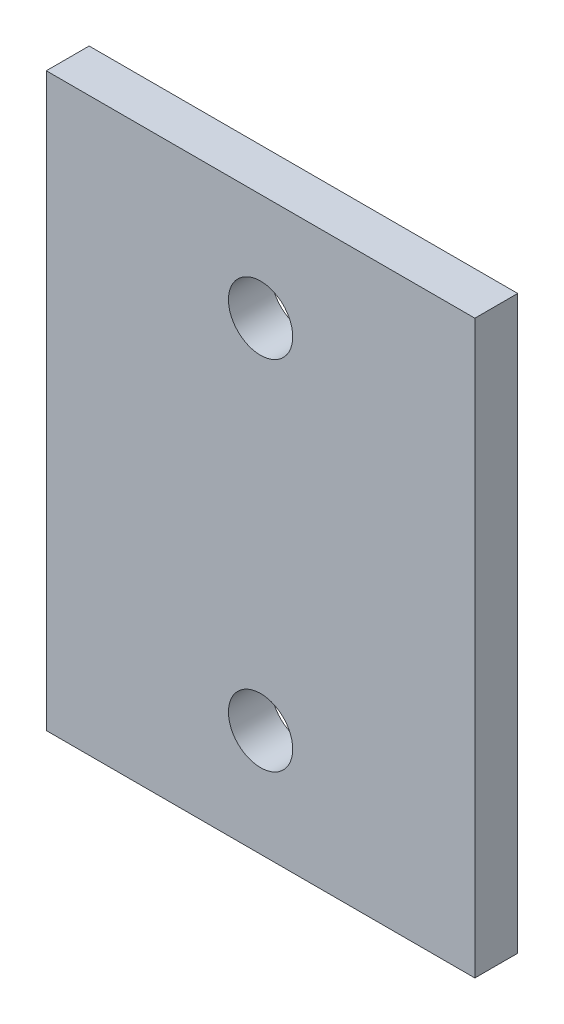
ISO-10303-21;
HEADER;
FILE_DESCRIPTION(('STEP AP214'),'2;1');
FILE_NAME('part.step','',(''),(''),'','','');
FILE_SCHEMA(('AUTOMOTIVE_DESIGN { 1 0 10303 214 1 1 1 1 }'));
ENDSEC;
DATA;
#1=APPLICATION_CONTEXT('core data for automotive mechanical design processes');
#2=APPLICATION_PROTOCOL_DEFINITION('international standard','automotive_design',2000,#1);
#3=PRODUCT_CONTEXT('',#1,'mechanical');
#4=PRODUCT('Part','Part','',(#3));
#5=PRODUCT_RELATED_PRODUCT_CATEGORY('part','',(#4));
#6=PRODUCT_DEFINITION_FORMATION('','',#4);
#7=PRODUCT_DEFINITION_CONTEXT('part definition',#1,'design');
#8=PRODUCT_DEFINITION('design','',#6,#7);
#9=PRODUCT_DEFINITION_SHAPE('','',#8);
#10=(LENGTH_UNIT() NAMED_UNIT(*) SI_UNIT(.MILLI.,.METRE.));
#11=(NAMED_UNIT(*) PLANE_ANGLE_UNIT() SI_UNIT($,.RADIAN.));
#12=(NAMED_UNIT(*) SI_UNIT($,.STERADIAN.) SOLID_ANGLE_UNIT());
#13=UNCERTAINTY_MEASURE_WITH_UNIT(LENGTH_MEASURE(1.E-05),#10,'distance_accuracy_value','');
#14=(GEOMETRIC_REPRESENTATION_CONTEXT(3) GLOBAL_UNCERTAINTY_ASSIGNED_CONTEXT((#13)) GLOBAL_UNIT_ASSIGNED_CONTEXT((#10,
#11,#12)) REPRESENTATION_CONTEXT('',''));
#15=CARTESIAN_POINT('',(0.,0.,0.));
#16=DIRECTION('',(0.,0.,1.));
#17=DIRECTION('',(1.,0.,0.));
#18=AXIS2_PLACEMENT_3D('',#15,#16,#17);
#19=CARTESIAN_POINT('',(0.,0.,6.));
#20=DIRECTION('',(0.,0.,1.));
#21=DIRECTION('',(1.,0.,0.));
#22=AXIS2_PLACEMENT_3D('',#19,#20,#21);
#23=PLANE('',#22);
#24=CARTESIAN_POINT('',(0.,25.,6.));
#25=DIRECTION('',(0.,0.,1.));
#26=DIRECTION('',(1.,0.,0.));
#27=AXIS2_PLACEMENT_3D('',#24,#25,#26);
#28=CIRCLE('',#27,4.5);
#29=CARTESIAN_POINT('',(4.5,25.,6.));
#30=VERTEX_POINT('',#29);
#31=EDGE_CURVE('E25',#30,#30,#28,.T.);
#32=ORIENTED_EDGE('',*,*,#31,.F.);
#33=EDGE_LOOP('',(#32));
#34=FACE_BOUND('',#33,.T.);
#35=CARTESIAN_POINT('',(0.,-25.,6.));
#36=DIRECTION('',(0.,0.,1.));
#37=DIRECTION('',(1.,0.,0.));
#38=AXIS2_PLACEMENT_3D('',#35,#36,#37);
#39=CIRCLE('',#38,4.5);
#40=CARTESIAN_POINT('',(4.5,-25.,6.));
#41=VERTEX_POINT('',#40);
#42=EDGE_CURVE('E81',#41,#41,#39,.T.);
#43=ORIENTED_EDGE('',*,*,#42,.F.);
#44=EDGE_LOOP('',(#43));
#45=FACE_BOUND('',#44,.T.);
#46=DIRECTION('',(1.,0.,0.));
#47=VECTOR('',#46,1.);
#48=CARTESIAN_POINT('',(-30.,-40.,6.));
#49=LINE('',#48,#47);
#50=CARTESIAN_POINT('',(-30.,-40.,6.));
#51=VERTEX_POINT('',#50);
#52=CARTESIAN_POINT('',(30.,-40.,6.));
#53=VERTEX_POINT('',#52);
#54=EDGE_CURVE('E129',#51,#53,#49,.T.);
#55=ORIENTED_EDGE('',*,*,#54,.T.);
#56=DIRECTION('',(0.,1.,0.));
#57=VECTOR('',#56,1.);
#58=CARTESIAN_POINT('',(30.,-40.,6.));
#59=LINE('',#58,#57);
#60=CARTESIAN_POINT('',(30.,40.,6.));
#61=VERTEX_POINT('',#60);
#62=EDGE_CURVE('E101',#53,#61,#59,.T.);
#63=ORIENTED_EDGE('',*,*,#62,.T.);
#64=DIRECTION('',(-1.,0.,0.));
#65=VECTOR('',#64,1.);
#66=CARTESIAN_POINT('',(30.,40.,6.));
#67=LINE('',#66,#65);
#68=CARTESIAN_POINT('',(-30.,40.,6.));
#69=VERTEX_POINT('',#68);
#70=EDGE_CURVE('E105',#61,#69,#67,.T.);
#71=ORIENTED_EDGE('',*,*,#70,.T.);
#72=DIRECTION('',(0.,-1.,0.));
#73=VECTOR('',#72,1.);
#74=CARTESIAN_POINT('',(-30.,40.,6.));
#75=LINE('',#74,#73);
#76=EDGE_CURVE('E95',#69,#51,#75,.T.);
#77=ORIENTED_EDGE('',*,*,#76,.T.);
#78=EDGE_LOOP('',(#55,#63,#71,#77));
#79=FACE_BOUND('',#78,.T.);
#80=ADVANCED_FACE('F16',(#34,#45,#79),#23,.T.);
#81=CARTESIAN_POINT('',(0.,0.,0.));
#82=DIRECTION('',(0.,0.,1.));
#83=DIRECTION('',(1.,0.,0.));
#84=AXIS2_PLACEMENT_3D('',#81,#82,#83);
#85=PLANE('',#84);
#86=CARTESIAN_POINT('',(0.,25.,0.));
#87=DIRECTION('',(0.,0.,1.));
#88=DIRECTION('',(1.,0.,0.));
#89=AXIS2_PLACEMENT_3D('',#86,#87,#88);
#90=CIRCLE('',#89,4.5);
#91=CARTESIAN_POINT('',(4.5,25.,0.));
#92=VERTEX_POINT('',#91);
#93=EDGE_CURVE('E10',#92,#92,#90,.T.);
#94=ORIENTED_EDGE('',*,*,#93,.T.);
#95=EDGE_LOOP('',(#94));
#96=FACE_BOUND('',#95,.T.);
#97=CARTESIAN_POINT('',(0.,-25.,0.));
#98=DIRECTION('',(0.,0.,1.));
#99=DIRECTION('',(1.,0.,0.));
#100=AXIS2_PLACEMENT_3D('',#97,#98,#99);
#101=CIRCLE('',#100,4.5);
#102=CARTESIAN_POINT('',(4.5,-25.,0.));
#103=VERTEX_POINT('',#102);
#104=EDGE_CURVE('E87',#103,#103,#101,.T.);
#105=ORIENTED_EDGE('',*,*,#104,.T.);
#106=EDGE_LOOP('',(#105));
#107=FACE_BOUND('',#106,.T.);
#108=DIRECTION('',(0.,-1.,0.));
#109=VECTOR('',#108,1.);
#110=CARTESIAN_POINT('',(-30.,40.,0.));
#111=LINE('',#110,#109);
#112=CARTESIAN_POINT('',(-30.,40.,0.));
#113=VERTEX_POINT('',#112);
#114=CARTESIAN_POINT('',(-30.,-40.,0.));
#115=VERTEX_POINT('',#114);
#116=EDGE_CURVE('E109',#113,#115,#111,.T.);
#117=ORIENTED_EDGE('',*,*,#116,.F.);
#118=DIRECTION('',(-1.,0.,0.));
#119=VECTOR('',#118,1.);
#120=CARTESIAN_POINT('',(30.,40.,0.));
#121=LINE('',#120,#119);
#122=CARTESIAN_POINT('',(30.,40.,0.));
#123=VERTEX_POINT('',#122);
#124=EDGE_CURVE('E104',#123,#113,#121,.T.);
#125=ORIENTED_EDGE('',*,*,#124,.F.);
#126=DIRECTION('',(0.,1.,0.));
#127=VECTOR('',#126,1.);
#128=CARTESIAN_POINT('',(30.,-40.,0.));
#129=LINE('',#128,#127);
#130=CARTESIAN_POINT('',(30.,-40.,0.));
#131=VERTEX_POINT('',#130);
#132=EDGE_CURVE('E136',#131,#123,#129,.T.);
#133=ORIENTED_EDGE('',*,*,#132,.F.);
#134=DIRECTION('',(1.,0.,0.));
#135=VECTOR('',#134,1.);
#136=CARTESIAN_POINT('',(-30.,-40.,0.));
#137=LINE('',#136,#135);
#138=EDGE_CURVE('E153',#115,#131,#137,.T.);
#139=ORIENTED_EDGE('',*,*,#138,.F.);
#140=EDGE_LOOP('',(#117,#125,#133,#139));
#141=FACE_BOUND('',#140,.T.);
#142=ADVANCED_FACE('F146',(#96,#107,#141),#85,.F.);
#143=CARTESIAN_POINT('',(0.,25.,0.));
#144=DIRECTION('',(0.,0.,-1.));
#145=DIRECTION('',(1.,0.,0.));
#146=AXIS2_PLACEMENT_3D('',#143,#144,#145);
#147=CYLINDRICAL_SURFACE('',#146,4.5);
#148=DIRECTION('',(0.,0.,1.));
#149=VECTOR('',#148,1.);
#150=CARTESIAN_POINT('',(4.5,25.,0.));
#151=LINE('',#150,#149);
#152=EDGE_CURVE('E93',#92,#30,#151,.T.);
#153=ORIENTED_EDGE('',*,*,#152,.T.);
#154=ORIENTED_EDGE('',*,*,#31,.T.);
#155=ORIENTED_EDGE('',*,*,#152,.F.);
#156=ORIENTED_EDGE('',*,*,#93,.F.);
#157=EDGE_LOOP('',(#153,#154,#155,#156));
#158=FACE_BOUND('',#157,.T.);
#159=ADVANCED_FACE('F144',(#158),#147,.F.);
#160=CARTESIAN_POINT('',(0.,-25.,0.));
#161=DIRECTION('',(0.,0.,-1.));
#162=DIRECTION('',(1.,0.,0.));
#163=AXIS2_PLACEMENT_3D('',#160,#161,#162);
#164=CYLINDRICAL_SURFACE('',#163,4.5);
#165=DIRECTION('',(0.,0.,1.));
#166=VECTOR('',#165,1.);
#167=CARTESIAN_POINT('',(4.5,-25.,0.));
#168=LINE('',#167,#166);
#169=EDGE_CURVE('E84',#103,#41,#168,.T.);
#170=ORIENTED_EDGE('',*,*,#169,.T.);
#171=ORIENTED_EDGE('',*,*,#42,.T.);
#172=ORIENTED_EDGE('',*,*,#169,.F.);
#173=ORIENTED_EDGE('',*,*,#104,.F.);
#174=EDGE_LOOP('',(#170,#171,#172,#173));
#175=FACE_BOUND('',#174,.T.);
#176=ADVANCED_FACE('F82',(#175),#164,.F.);
#177=CARTESIAN_POINT('',(-30.,40.,0.));
#178=DIRECTION('',(1.,0.,0.));
#179=DIRECTION('',(0.,1.,0.));
#180=AXIS2_PLACEMENT_3D('',#177,#178,#179);
#181=PLANE('',#180);
#182=ORIENTED_EDGE('',*,*,#116,.T.);
#183=DIRECTION('',(0.,0.,1.));
#184=VECTOR('',#183,1.);
#185=CARTESIAN_POINT('',(-30.,-40.,0.));
#186=LINE('',#185,#184);
#187=EDGE_CURVE('E133',#115,#51,#186,.T.);
#188=ORIENTED_EDGE('',*,*,#187,.T.);
#189=ORIENTED_EDGE('',*,*,#76,.F.);
#190=DIRECTION('',(0.,0.,1.));
#191=VECTOR('',#190,1.);
#192=CARTESIAN_POINT('',(-30.,40.,0.));
#193=LINE('',#192,#191);
#194=EDGE_CURVE('E110',#113,#69,#193,.T.);
#195=ORIENTED_EDGE('',*,*,#194,.F.);
#196=EDGE_LOOP('',(#182,#188,#189,#195));
#197=FACE_BOUND('',#196,.T.);
#198=ADVANCED_FACE('F154',(#197),#181,.F.);
#199=CARTESIAN_POINT('',(30.,40.,0.));
#200=DIRECTION('',(0.,-1.,0.));
#201=DIRECTION('',(0.,0.,-1.));
#202=AXIS2_PLACEMENT_3D('',#199,#200,#201);
#203=PLANE('',#202);
#204=ORIENTED_EDGE('',*,*,#124,.T.);
#205=ORIENTED_EDGE('',*,*,#194,.T.);
#206=ORIENTED_EDGE('',*,*,#70,.F.);
#207=DIRECTION('',(0.,0.,1.));
#208=VECTOR('',#207,1.);
#209=CARTESIAN_POINT('',(30.,40.,0.));
#210=LINE('',#209,#208);
#211=EDGE_CURVE('E99',#123,#61,#210,.T.);
#212=ORIENTED_EDGE('',*,*,#211,.F.);
#213=EDGE_LOOP('',(#204,#205,#206,#212));
#214=FACE_BOUND('',#213,.T.);
#215=ADVANCED_FACE('F156',(#214),#203,.F.);
#216=CARTESIAN_POINT('',(30.,-40.,0.));
#217=DIRECTION('',(-1.,0.,0.));
#218=DIRECTION('',(0.,0.,1.));
#219=AXIS2_PLACEMENT_3D('',#216,#217,#218);
#220=PLANE('',#219);
#221=ORIENTED_EDGE('',*,*,#132,.T.);
#222=ORIENTED_EDGE('',*,*,#211,.T.);
#223=ORIENTED_EDGE('',*,*,#62,.F.);
#224=DIRECTION('',(0.,0.,1.));
#225=VECTOR('',#224,1.);
#226=CARTESIAN_POINT('',(30.,-40.,0.));
#227=LINE('',#226,#225);
#228=EDGE_CURVE('E162',#131,#53,#227,.T.);
#229=ORIENTED_EDGE('',*,*,#228,.F.);
#230=EDGE_LOOP('',(#221,#222,#223,#229));
#231=FACE_BOUND('',#230,.T.);
#232=ADVANCED_FACE('F160',(#231),#220,.F.);
#233=CARTESIAN_POINT('',(-30.,-40.,0.));
#234=DIRECTION('',(0.,1.,0.));
#235=DIRECTION('',(1.,0.,0.));
#236=AXIS2_PLACEMENT_3D('',#233,#234,#235);
#237=PLANE('',#236);
#238=ORIENTED_EDGE('',*,*,#138,.T.);
#239=ORIENTED_EDGE('',*,*,#228,.T.);
#240=ORIENTED_EDGE('',*,*,#54,.F.);
#241=ORIENTED_EDGE('',*,*,#187,.F.);
#242=EDGE_LOOP('',(#238,#239,#240,#241));
#243=FACE_BOUND('',#242,.T.);
#244=ADVANCED_FACE('F166',(#243),#237,.F.);
#245=CLOSED_SHELL('',(#80,#142,#159,#176,#198,#215,#232,#244));
#246=MANIFOLD_SOLID_BREP('B1',#245);
#247=ADVANCED_BREP_SHAPE_REPRESENTATION('',(#18,#246),#14);
#248=SHAPE_DEFINITION_REPRESENTATION(#9,#247);
ENDSEC;
END-ISO-10303-21;
